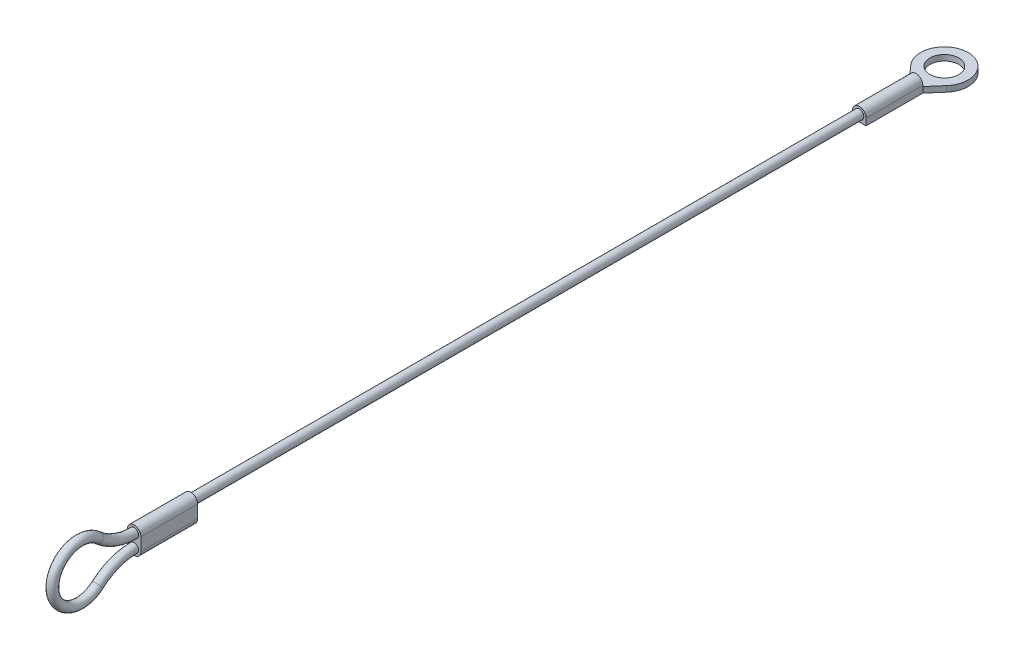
ISO-10303-21;
HEADER;
FILE_DESCRIPTION(('STEP AP214'),'2;1');
FILE_NAME('part.step','',(''),(''),'','','');
FILE_SCHEMA(('AUTOMOTIVE_DESIGN { 1 0 10303 214 1 1 1 1 }'));
ENDSEC;
DATA;
#1=APPLICATION_CONTEXT('core data for automotive mechanical design processes');
#2=APPLICATION_PROTOCOL_DEFINITION('international standard','automotive_design',2000,#1);
#3=PRODUCT_CONTEXT('',#1,'mechanical');
#4=PRODUCT('Part','Part','',(#3));
#5=PRODUCT_RELATED_PRODUCT_CATEGORY('part','',(#4));
#6=PRODUCT_DEFINITION_FORMATION('','',#4);
#7=PRODUCT_DEFINITION_CONTEXT('part definition',#1,'design');
#8=PRODUCT_DEFINITION('design','',#6,#7);
#9=PRODUCT_DEFINITION_SHAPE('','',#8);
#10=(LENGTH_UNIT() NAMED_UNIT(*) SI_UNIT(.MILLI.,.METRE.));
#11=(NAMED_UNIT(*) PLANE_ANGLE_UNIT() SI_UNIT($,.RADIAN.));
#12=(NAMED_UNIT(*) SI_UNIT($,.STERADIAN.) SOLID_ANGLE_UNIT());
#13=UNCERTAINTY_MEASURE_WITH_UNIT(LENGTH_MEASURE(1.E-05),#10,'distance_accuracy_value','');
#14=(GEOMETRIC_REPRESENTATION_CONTEXT(3) GLOBAL_UNCERTAINTY_ASSIGNED_CONTEXT((#13)) GLOBAL_UNIT_ASSIGNED_CONTEXT((#10,
#11,#12)) REPRESENTATION_CONTEXT('',''));
#15=CARTESIAN_POINT('',(0.,0.,0.));
#16=DIRECTION('',(0.,0.,1.));
#17=DIRECTION('',(1.,0.,0.));
#18=AXIS2_PLACEMENT_3D('',#15,#16,#17);
#19=CARTESIAN_POINT('',(0.,0.,-10.));
#20=DIRECTION('',(0.,0.,-1.));
#21=DIRECTION('',(-1.,0.,0.));
#22=AXIS2_PLACEMENT_3D('',#19,#20,#21);
#23=PLANE('',#22);
#24=DIRECTION('',(0.,-1.,0.));
#25=VECTOR('',#24,1.);
#26=CARTESIAN_POINT('',(1.2,0.,-10.));
#27=LINE('',#26,#25);
#28=CARTESIAN_POINT('',(1.2,0.,-10.));
#29=VERTEX_POINT('',#28);
#30=CARTESIAN_POINT('',(1.2,-0.19,-10.));
#31=VERTEX_POINT('',#30);
#32=EDGE_CURVE('E189',#29,#31,#27,.T.);
#33=ORIENTED_EDGE('',*,*,#32,.T.);
#34=DIRECTION('',(-1.,0.,0.));
#35=VECTOR('',#34,1.);
#36=CARTESIAN_POINT('',(-1.2,-0.19,-10.));
#37=LINE('',#36,#35);
#38=CARTESIAN_POINT('',(-1.2,-0.19,-10.));
#39=VERTEX_POINT('',#38);
#40=EDGE_CURVE('E146',#31,#39,#37,.T.);
#41=ORIENTED_EDGE('',*,*,#40,.T.);
#42=DIRECTION('',(0.,1.,0.));
#43=VECTOR('',#42,1.);
#44=CARTESIAN_POINT('',(-1.2,-1.2,-10.));
#45=LINE('',#44,#43);
#46=CARTESIAN_POINT('',(-1.2,0.,-10.));
#47=VERTEX_POINT('',#46);
#48=EDGE_CURVE('E194',#39,#47,#45,.T.);
#49=ORIENTED_EDGE('',*,*,#48,.T.);
#50=CARTESIAN_POINT('',(0.,0.,-10.));
#51=DIRECTION('',(0.,0.,-1.));
#52=DIRECTION('',(-1.,0.,0.));
#53=AXIS2_PLACEMENT_3D('',#50,#51,#52);
#54=CIRCLE('',#53,1.2);
#55=EDGE_CURVE('E185',#47,#29,#54,.T.);
#56=ORIENTED_EDGE('',*,*,#55,.T.);
#57=EDGE_LOOP('',(#33,#41,#49,#56));
#58=FACE_BOUND('',#57,.T.);
#59=ADVANCED_FACE('F39',(#58),#23,.T.);
#60=CARTESIAN_POINT('',(0.,0.,127.8));
#61=DIRECTION('',(0.,0.,-1.));
#62=DIRECTION('',(-1.,0.,0.));
#63=AXIS2_PLACEMENT_3D('',#60,#61,#62);
#64=CYLINDRICAL_SURFACE('',#63,0.795);
#65=CARTESIAN_POINT('',(0.,0.,117.8));
#66=DIRECTION('',(0.,0.,-1.));
#67=DIRECTION('',(0.,1.,0.));
#68=AXIS2_PLACEMENT_3D('',#65,#66,#67);
#69=CIRCLE('',#68,0.795);
#70=CARTESIAN_POINT('',(0.,0.795,117.8));
#71=VERTEX_POINT('',#70);
#72=EDGE_CURVE('E43',#71,#71,#69,.T.);
#73=ORIENTED_EDGE('',*,*,#72,.T.);
#74=EDGE_LOOP('',(#73));
#75=FACE_BOUND('',#74,.T.);
#76=CARTESIAN_POINT('',(0.,0.,0.));
#77=DIRECTION('',(0.,0.,1.));
#78=DIRECTION('',(1.,0.,0.));
#79=AXIS2_PLACEMENT_3D('',#76,#77,#78);
#80=CIRCLE('',#79,0.795);
#81=CARTESIAN_POINT('',(0.795,0.,0.));
#82=VERTEX_POINT('',#81);
#83=EDGE_CURVE('E224',#82,#82,#80,.T.);
#84=ORIENTED_EDGE('',*,*,#83,.T.);
#85=EDGE_LOOP('',(#84));
#86=FACE_BOUND('',#85,.T.);
#87=ADVANCED_FACE('F41',(#75,#86),#64,.T.);
#88=CARTESIAN_POINT('',(0.,1.70292021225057E-13,117.8));
#89=DIRECTION('',(0.,0.,1.));
#90=DIRECTION('',(0.,-1.,0.));
#91=AXIS2_PLACEMENT_3D('',#88,#89,#90);
#92=CYLINDRICAL_SURFACE('',#91,1.2);
#93=CARTESIAN_POINT('',(0.,1.8474805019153E-13,127.8));
#94=DIRECTION('',(0.,0.,-1.));
#95=DIRECTION('',(0.,1.,0.));
#96=AXIS2_PLACEMENT_3D('',#93,#94,#95);
#97=CIRCLE('',#96,1.2);
#98=CARTESIAN_POINT('',(-1.2,1.84895007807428E-13,127.8));
#99=VERTEX_POINT('',#98);
#100=CARTESIAN_POINT('',(1.2,1.84601092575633E-13,127.8));
#101=VERTEX_POINT('',#100);
#102=EDGE_CURVE('E236',#99,#101,#97,.T.);
#103=ORIENTED_EDGE('',*,*,#102,.T.);
#104=DIRECTION('',(0.,0.,1.));
#105=VECTOR('',#104,1.);
#106=CARTESIAN_POINT('',(1.2,1.70145063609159E-13,117.8));
#107=LINE('',#106,#105);
#108=CARTESIAN_POINT('',(1.2,1.70145063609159E-13,117.8));
#109=VERTEX_POINT('',#108);
#110=EDGE_CURVE('E257',#109,#101,#107,.T.);
#111=ORIENTED_EDGE('',*,*,#110,.F.);
#112=CARTESIAN_POINT('',(0.,1.70292021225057E-13,117.8));
#113=DIRECTION('',(0.,0.,-1.));
#114=DIRECTION('',(0.,1.,0.));
#115=AXIS2_PLACEMENT_3D('',#112,#113,#114);
#116=CIRCLE('',#115,1.2);
#117=CARTESIAN_POINT('',(-1.2,1.70438978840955E-13,117.8));
#118=VERTEX_POINT('',#117);
#119=EDGE_CURVE('E225',#118,#109,#116,.T.);
#120=ORIENTED_EDGE('',*,*,#119,.F.);
#121=DIRECTION('',(0.,0.,1.));
#122=VECTOR('',#121,1.);
#123=CARTESIAN_POINT('',(-1.2,1.70438978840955E-13,117.8));
#124=LINE('',#123,#122);
#125=EDGE_CURVE('E235',#118,#99,#124,.T.);
#126=ORIENTED_EDGE('',*,*,#125,.T.);
#127=EDGE_LOOP('',(#103,#111,#120,#126));
#128=FACE_BOUND('',#127,.T.);
#129=ADVANCED_FACE('F313',(#128),#92,.T.);
#130=CARTESIAN_POINT('',(1.2,1.70145063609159E-13,117.8));
#131=DIRECTION('',(-1.,0.,0.));
#132=DIRECTION('',(0.,-1.,0.));
#133=AXIS2_PLACEMENT_3D('',#130,#131,#132);
#134=PLANE('',#133);
#135=DIRECTION('',(0.,-1.,0.));
#136=VECTOR('',#135,1.);
#137=CARTESIAN_POINT('',(1.2,1.84601092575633E-13,127.8));
#138=LINE('',#137,#136);
#139=CARTESIAN_POINT('',(1.2,-2.26625258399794,127.8));
#140=VERTEX_POINT('',#139);
#141=EDGE_CURVE('E240',#101,#140,#138,.T.);
#142=ORIENTED_EDGE('',*,*,#141,.T.);
#143=DIRECTION('',(0.,0.,1.));
#144=VECTOR('',#143,1.);
#145=CARTESIAN_POINT('',(1.2,-2.26625258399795,117.8));
#146=LINE('',#145,#144);
#147=CARTESIAN_POINT('',(1.2,-2.26625258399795,117.8));
#148=VERTEX_POINT('',#147);
#149=EDGE_CURVE('E253',#148,#140,#146,.T.);
#150=ORIENTED_EDGE('',*,*,#149,.F.);
#151=DIRECTION('',(0.,-1.,0.));
#152=VECTOR('',#151,1.);
#153=CARTESIAN_POINT('',(1.2,1.70145063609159E-13,117.8));
#154=LINE('',#153,#152);
#155=EDGE_CURVE('E95',#109,#148,#154,.T.);
#156=ORIENTED_EDGE('',*,*,#155,.F.);
#157=ORIENTED_EDGE('',*,*,#110,.T.);
#158=EDGE_LOOP('',(#142,#150,#156,#157));
#159=FACE_BOUND('',#158,.T.);
#160=ADVANCED_FACE('F315',(#159),#134,.F.);
#161=CARTESIAN_POINT('',(0.,-2.26625258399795,117.8));
#162=DIRECTION('',(0.,0.,1.));
#163=DIRECTION('',(0.,-1.,0.));
#164=AXIS2_PLACEMENT_3D('',#161,#162,#163);
#165=CYLINDRICAL_SURFACE('',#164,1.2);
#166=CARTESIAN_POINT('',(0.,-2.26625258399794,127.8));
#167=DIRECTION('',(0.,0.,-1.));
#168=DIRECTION('',(0.,1.,0.));
#169=AXIS2_PLACEMENT_3D('',#166,#167,#168);
#170=CIRCLE('',#169,1.2);
#171=CARTESIAN_POINT('',(-1.2,-2.26625258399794,127.8));
#172=VERTEX_POINT('',#171);
#173=EDGE_CURVE('E243',#140,#172,#170,.T.);
#174=ORIENTED_EDGE('',*,*,#173,.T.);
#175=DIRECTION('',(0.,0.,1.));
#176=VECTOR('',#175,1.);
#177=CARTESIAN_POINT('',(-1.2,-2.26625258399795,117.8));
#178=LINE('',#177,#176);
#179=CARTESIAN_POINT('',(-1.2,-2.26625258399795,117.8));
#180=VERTEX_POINT('',#179);
#181=EDGE_CURVE('E250',#180,#172,#178,.T.);
#182=ORIENTED_EDGE('',*,*,#181,.F.);
#183=CARTESIAN_POINT('',(0.,-2.26625258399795,117.8));
#184=DIRECTION('',(0.,0.,-1.));
#185=DIRECTION('',(0.,1.,0.));
#186=AXIS2_PLACEMENT_3D('',#183,#184,#185);
#187=CIRCLE('',#186,1.2);
#188=EDGE_CURVE('E230',#148,#180,#187,.T.);
#189=ORIENTED_EDGE('',*,*,#188,.F.);
#190=ORIENTED_EDGE('',*,*,#149,.T.);
#191=EDGE_LOOP('',(#174,#182,#189,#190));
#192=FACE_BOUND('',#191,.T.);
#193=ADVANCED_FACE('F320',(#192),#165,.T.);
#194=CARTESIAN_POINT('',(-1.2,1.70438978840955E-13,117.8));
#195=DIRECTION('',(1.,0.,0.));
#196=DIRECTION('',(0.,0.,-1.));
#197=AXIS2_PLACEMENT_3D('',#194,#195,#196);
#198=PLANE('',#197);
#199=DIRECTION('',(0.,1.,0.));
#200=VECTOR('',#199,1.);
#201=CARTESIAN_POINT('',(-1.2,1.84895007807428E-13,127.8));
#202=LINE('',#201,#200);
#203=EDGE_CURVE('E87',#172,#99,#202,.T.);
#204=ORIENTED_EDGE('',*,*,#203,.T.);
#205=ORIENTED_EDGE('',*,*,#125,.F.);
#206=DIRECTION('',(0.,1.,0.));
#207=VECTOR('',#206,1.);
#208=CARTESIAN_POINT('',(-1.2,1.70438978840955E-13,117.8));
#209=LINE('',#208,#207);
#210=EDGE_CURVE('E66',#180,#118,#209,.T.);
#211=ORIENTED_EDGE('',*,*,#210,.F.);
#212=ORIENTED_EDGE('',*,*,#181,.T.);
#213=EDGE_LOOP('',(#204,#205,#211,#212));
#214=FACE_BOUND('',#213,.T.);
#215=ADVANCED_FACE('F308',(#214),#198,.F.);
#216=CARTESIAN_POINT('',(0.,1.70292021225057E-13,117.8));
#217=DIRECTION('',(0.,0.,-1.));
#218=DIRECTION('',(0.,1.,0.));
#219=AXIS2_PLACEMENT_3D('',#216,#217,#218);
#220=PLANE('',#219);
#221=ORIENTED_EDGE('',*,*,#72,.F.);
#222=EDGE_LOOP('',(#221));
#223=FACE_BOUND('',#222,.T.);
#224=ORIENTED_EDGE('',*,*,#119,.T.);
#225=ORIENTED_EDGE('',*,*,#155,.T.);
#226=ORIENTED_EDGE('',*,*,#188,.T.);
#227=ORIENTED_EDGE('',*,*,#210,.T.);
#228=EDGE_LOOP('',(#224,#225,#226,#227));
#229=FACE_BOUND('',#228,.T.);
#230=ADVANCED_FACE('F305',(#223,#229),#220,.T.);
#231=CARTESIAN_POINT('',(0.,1.8474805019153E-13,127.8));
#232=DIRECTION('',(0.,0.,-1.));
#233=DIRECTION('',(0.,1.,0.));
#234=AXIS2_PLACEMENT_3D('',#231,#232,#233);
#235=PLANE('',#234);
#236=CARTESIAN_POINT('',(0.,-2.26625258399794,127.8));
#237=DIRECTION('',(0.,0.,-1.));
#238=DIRECTION('',(1.,0.,0.));
#239=AXIS2_PLACEMENT_3D('',#236,#237,#238);
#240=CIRCLE('',#239,0.795);
#241=CARTESIAN_POINT('',(0.,-1.47125258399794,127.8));
#242=VERTEX_POINT('',#241);
#243=EDGE_CURVE('E263',#242,#242,#240,.T.);
#244=ORIENTED_EDGE('',*,*,#243,.T.);
#245=EDGE_LOOP('',(#244));
#246=FACE_BOUND('',#245,.T.);
#247=CARTESIAN_POINT('',(0.,0.,127.8));
#248=DIRECTION('',(0.,0.,-1.));
#249=DIRECTION('',(0.,1.,0.));
#250=AXIS2_PLACEMENT_3D('',#247,#248,#249);
#251=CIRCLE('',#250,0.795);
#252=CARTESIAN_POINT('',(0.,-0.795000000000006,127.8));
#253=VERTEX_POINT('',#252);
#254=EDGE_CURVE('E260',#253,#253,#251,.T.);
#255=ORIENTED_EDGE('',*,*,#254,.T.);
#256=EDGE_LOOP('',(#255));
#257=FACE_BOUND('',#256,.T.);
#258=ORIENTED_EDGE('',*,*,#102,.F.);
#259=ORIENTED_EDGE('',*,*,#203,.F.);
#260=ORIENTED_EDGE('',*,*,#173,.F.);
#261=ORIENTED_EDGE('',*,*,#141,.F.);
#262=EDGE_LOOP('',(#258,#259,#260,#261));
#263=FACE_BOUND('',#262,.T.);
#264=ADVANCED_FACE('F307',(#246,#257,#263),#235,.F.);
#265=CARTESIAN_POINT('',(0.,-11.8662525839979,127.8));
#266=DIRECTION('',(1.,0.,0.));
#267=DIRECTION('',(0.,0.,-1.));
#268=AXIS2_PLACEMENT_3D('',#265,#266,#267);
#269=TOROIDAL_SURFACE('',#268,9.6,0.795);
#270=CARTESIAN_POINT('',(0.,-4.71083505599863,134.2));
#271=DIRECTION('',(0.,0.666666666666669,-0.745355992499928));
#272=DIRECTION('',(1.,0.,0.));
#273=AXIS2_PLACEMENT_3D('',#270,#271,#272);
#274=CIRCLE('',#273,0.795);
#275=CARTESIAN_POINT('',(0.,-4.11827704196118,134.73));
#276=VERTEX_POINT('',#275);
#277=EDGE_CURVE('E49',#276,#276,#274,.T.);
#278=CARTESIAN_POINT('',(0.,-11.8662525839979,127.8));
#279=DIRECTION('',(1.,0.,0.));
#280=DIRECTION('',(0.,0.,-1.));
#281=AXIS2_PLACEMENT_3D('',#278,#279,#280);
#282=CIRCLE('',#281,10.395);
#283=EDGE_CURVE('',#242,#276,#282,.T.);
#284=ORIENTED_EDGE('',*,*,#243,.F.);
#285=ORIENTED_EDGE('',*,*,#277,.T.);
#286=ORIENTED_EDGE('',*,*,#283,.T.);
#287=ORIENTED_EDGE('',*,*,#283,.F.);
#288=EDGE_LOOP('',(#284,#286,#285,#287));
#289=FACE_BOUND('',#288,.T.);
#290=ADVANCED_FACE('F323',(#289),#269,.T.);
#291=CARTESIAN_POINT('',(0.,-1.13312629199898,137.4));
#292=DIRECTION('',(-1.,0.,0.));
#293=DIRECTION('',(0.,0.,1.));
#294=AXIS2_PLACEMENT_3D('',#291,#292,#293);
#295=TOROIDAL_SURFACE('',#294,4.79999999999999,0.795);
#296=CARTESIAN_POINT('',(0.,2.44458247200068,134.2));
#297=DIRECTION('',(0.,0.666666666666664,0.745355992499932));
#298=DIRECTION('',(1.,0.,0.));
#299=AXIS2_PLACEMENT_3D('',#296,#297,#298);
#300=CIRCLE('',#299,0.795);
#301=CARTESIAN_POINT('',(0.,1.85202445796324,134.73));
#302=VERTEX_POINT('',#301);
#303=EDGE_CURVE('E11',#302,#302,#300,.T.);
#304=ORIENTED_EDGE('',*,*,#303,.T.);
#305=EDGE_LOOP('',(#304));
#306=FACE_BOUND('',#305,.T.);
#307=ORIENTED_EDGE('',*,*,#277,.F.);
#308=EDGE_LOOP('',(#307));
#309=FACE_BOUND('',#308,.T.);
#310=ADVANCED_FACE('F329',(#306,#309),#295,.T.);
#311=CARTESIAN_POINT('',(0.,9.6,127.8));
#312=DIRECTION('',(1.,0.,0.));
#313=DIRECTION('',(0.,0.,-1.));
#314=AXIS2_PLACEMENT_3D('',#311,#312,#313);
#315=TOROIDAL_SURFACE('',#314,9.6,0.795);
#316=CARTESIAN_POINT('',(0.,9.6,127.8));
#317=DIRECTION('',(1.,0.,0.));
#318=DIRECTION('',(0.,0.,-1.));
#319=AXIS2_PLACEMENT_3D('',#316,#317,#318);
#320=CIRCLE('',#319,10.395);
#321=EDGE_CURVE('',#302,#253,#320,.T.);
#322=ORIENTED_EDGE('',*,*,#303,.F.);
#323=ORIENTED_EDGE('',*,*,#254,.F.);
#324=ORIENTED_EDGE('',*,*,#321,.T.);
#325=ORIENTED_EDGE('',*,*,#321,.F.);
#326=EDGE_LOOP('',(#322,#324,#323,#325));
#327=FACE_BOUND('',#326,.T.);
#328=ADVANCED_FACE('F349',(#327),#315,.T.);
#329=CARTESIAN_POINT('',(0.,0.,-10.));
#330=DIRECTION('',(0.,0.,1.));
#331=DIRECTION('',(1.,0.,0.));
#332=AXIS2_PLACEMENT_3D('',#329,#330,#331);
#333=CYLINDRICAL_SURFACE('',#332,1.2);
#334=CARTESIAN_POINT('',(0.,0.,0.));
#335=DIRECTION('',(0.,0.,-1.));
#336=DIRECTION('',(-1.,0.,0.));
#337=AXIS2_PLACEMENT_3D('',#334,#335,#336);
#338=CIRCLE('',#337,1.2);
#339=CARTESIAN_POINT('',(-1.2,0.,0.));
#340=VERTEX_POINT('',#339);
#341=CARTESIAN_POINT('',(1.2,0.,0.));
#342=VERTEX_POINT('',#341);
#343=EDGE_CURVE('E182',#340,#342,#338,.T.);
#344=ORIENTED_EDGE('',*,*,#343,.T.);
#345=DIRECTION('',(0.,0.,1.));
#346=VECTOR('',#345,1.);
#347=CARTESIAN_POINT('',(1.2,0.,-10.));
#348=LINE('',#347,#346);
#349=EDGE_CURVE('E220',#29,#342,#348,.T.);
#350=ORIENTED_EDGE('',*,*,#349,.F.);
#351=ORIENTED_EDGE('',*,*,#55,.F.);
#352=DIRECTION('',(0.,0.,1.));
#353=VECTOR('',#352,1.);
#354=CARTESIAN_POINT('',(-1.2,0.,-10.));
#355=LINE('',#354,#353);
#356=EDGE_CURVE('E197',#47,#340,#355,.T.);
#357=ORIENTED_EDGE('',*,*,#356,.T.);
#358=EDGE_LOOP('',(#344,#350,#351,#357));
#359=FACE_BOUND('',#358,.T.);
#360=ADVANCED_FACE('F283',(#359),#333,.T.);
#361=CARTESIAN_POINT('',(1.2,0.,-10.));
#362=DIRECTION('',(-1.,0.,0.));
#363=DIRECTION('',(0.,0.,1.));
#364=AXIS2_PLACEMENT_3D('',#361,#362,#363);
#365=PLANE('',#364);
#366=DIRECTION('',(0.,-1.,0.));
#367=VECTOR('',#366,1.);
#368=CARTESIAN_POINT('',(1.2,0.,0.));
#369=LINE('',#368,#367);
#370=CARTESIAN_POINT('',(1.2,-1.2,0.));
#371=VERTEX_POINT('',#370);
#372=EDGE_CURVE('E201',#342,#371,#369,.T.);
#373=ORIENTED_EDGE('',*,*,#372,.T.);
#374=DIRECTION('',(0.,0.,1.));
#375=VECTOR('',#374,1.);
#376=CARTESIAN_POINT('',(1.2,-1.2,-10.));
#377=LINE('',#376,#375);
#378=CARTESIAN_POINT('',(1.2,-1.2,-10.));
#379=VERTEX_POINT('',#378);
#380=EDGE_CURVE('E216',#379,#371,#377,.T.);
#381=ORIENTED_EDGE('',*,*,#380,.F.);
#382=DIRECTION('',(0.,-1.,0.));
#383=VECTOR('',#382,1.);
#384=CARTESIAN_POINT('',(1.2,-0.19,-10.));
#385=LINE('',#384,#383);
#386=EDGE_CURVE('E179',#31,#379,#385,.T.);
#387=ORIENTED_EDGE('',*,*,#386,.F.);
#388=ORIENTED_EDGE('',*,*,#32,.F.);
#389=ORIENTED_EDGE('',*,*,#349,.T.);
#390=EDGE_LOOP('',(#373,#381,#387,#388,#389));
#391=FACE_BOUND('',#390,.T.);
#392=ADVANCED_FACE('F294',(#391),#365,.F.);
#393=CARTESIAN_POINT('',(0.,-1.2,-10.));
#394=DIRECTION('',(0.,1.,0.));
#395=DIRECTION('',(0.,0.,1.));
#396=AXIS2_PLACEMENT_3D('',#393,#394,#395);
#397=PLANE('',#396);
#398=DIRECTION('',(-1.,0.,0.));
#399=VECTOR('',#398,1.);
#400=CARTESIAN_POINT('',(0.,-1.2,0.));
#401=LINE('',#400,#399);
#402=CARTESIAN_POINT('',(-1.2,-1.2,0.));
#403=VERTEX_POINT('',#402);
#404=EDGE_CURVE('E204',#371,#403,#401,.T.);
#405=ORIENTED_EDGE('',*,*,#404,.T.);
#406=DIRECTION('',(0.,0.,1.));
#407=VECTOR('',#406,1.);
#408=CARTESIAN_POINT('',(-1.2,-1.2,-10.));
#409=LINE('',#408,#407);
#410=CARTESIAN_POINT('',(-1.2,-1.2,-10.));
#411=VERTEX_POINT('',#410);
#412=EDGE_CURVE('E212',#411,#403,#409,.T.);
#413=ORIENTED_EDGE('',*,*,#412,.F.);
#414=DIRECTION('',(-0.657083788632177,0.,-0.753817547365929));
#415=VECTOR('',#414,1.);
#416=CARTESIAN_POINT('',(-3.15849552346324,-1.2,-12.2468189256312));
#417=LINE('',#416,#415);
#418=CARTESIAN_POINT('',(-3.15849552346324,-1.2,-12.2468189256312));
#419=VERTEX_POINT('',#418);
#420=EDGE_CURVE('E173',#411,#419,#417,.T.);
#421=ORIENTED_EDGE('',*,*,#420,.T.);
#422=CARTESIAN_POINT('',(0.,-1.2,-15.));
#423=DIRECTION('',(0.,-1.,0.));
#424=DIRECTION('',(0.,0.,1.));
#425=AXIS2_PLACEMENT_3D('',#422,#423,#424);
#426=CIRCLE('',#425,4.19);
#427=CARTESIAN_POINT('',(3.15849552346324,-1.2,-12.2468189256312));
#428=VERTEX_POINT('',#427);
#429=EDGE_CURVE('E141',#419,#428,#426,.T.);
#430=ORIENTED_EDGE('',*,*,#429,.T.);
#431=DIRECTION('',(-0.657083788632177,0.,0.753817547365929));
#432=VECTOR('',#431,1.);
#433=CARTESIAN_POINT('',(1.2,-1.2,-10.));
#434=LINE('',#433,#432);
#435=EDGE_CURVE('E158',#428,#379,#434,.T.);
#436=ORIENTED_EDGE('',*,*,#435,.T.);
#437=ORIENTED_EDGE('',*,*,#380,.T.);
#438=EDGE_LOOP('',(#405,#413,#421,#430,#436,#437));
#439=FACE_BOUND('',#438,.T.);
#440=CARTESIAN_POINT('',(0.,-1.2,-15.));
#441=DIRECTION('',(0.,-1.,0.));
#442=DIRECTION('',(0.,0.,-1.));
#443=AXIS2_PLACEMENT_3D('',#440,#441,#442);
#444=CIRCLE('',#443,2.54);
#445=CARTESIAN_POINT('',(0.,-1.2,-17.54));
#446=VERTEX_POINT('',#445);
#447=EDGE_CURVE('E166',#446,#446,#444,.T.);
#448=ORIENTED_EDGE('',*,*,#447,.F.);
#449=EDGE_LOOP('',(#448));
#450=FACE_BOUND('',#449,.T.);
#451=ADVANCED_FACE('F290',(#439,#450),#397,.F.);
#452=CARTESIAN_POINT('',(-1.2,-1.2,-10.));
#453=DIRECTION('',(1.,0.,0.));
#454=DIRECTION('',(0.,0.,-1.));
#455=AXIS2_PLACEMENT_3D('',#452,#453,#454);
#456=PLANE('',#455);
#457=DIRECTION('',(0.,1.,0.));
#458=VECTOR('',#457,1.);
#459=CARTESIAN_POINT('',(-1.2,-1.2,0.));
#460=LINE('',#459,#458);
#461=EDGE_CURVE('E190',#403,#340,#460,.T.);
#462=ORIENTED_EDGE('',*,*,#461,.T.);
#463=ORIENTED_EDGE('',*,*,#356,.F.);
#464=ORIENTED_EDGE('',*,*,#48,.F.);
#465=EDGE_CURVE('E155',#411,#39,#45,.T.);
#466=ORIENTED_EDGE('',*,*,#465,.F.);
#467=ORIENTED_EDGE('',*,*,#412,.T.);
#468=EDGE_LOOP('',(#462,#463,#464,#466,#467));
#469=FACE_BOUND('',#468,.T.);
#470=ADVANCED_FACE('F277',(#469),#456,.F.);
#471=CARTESIAN_POINT('',(0.,0.,0.));
#472=DIRECTION('',(0.,0.,-1.));
#473=DIRECTION('',(-1.,0.,0.));
#474=AXIS2_PLACEMENT_3D('',#471,#472,#473);
#475=PLANE('',#474);
#476=ORIENTED_EDGE('',*,*,#83,.F.);
#477=EDGE_LOOP('',(#476));
#478=FACE_BOUND('',#477,.T.);
#479=ORIENTED_EDGE('',*,*,#343,.F.);
#480=ORIENTED_EDGE('',*,*,#461,.F.);
#481=ORIENTED_EDGE('',*,*,#404,.F.);
#482=ORIENTED_EDGE('',*,*,#372,.F.);
#483=EDGE_LOOP('',(#479,#480,#481,#482));
#484=FACE_BOUND('',#483,.T.);
#485=ADVANCED_FACE('F274',(#478,#484),#475,.F.);
#486=CARTESIAN_POINT('',(-3.15849552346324,-0.19,-12.2468189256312));
#487=DIRECTION('',(-0.753817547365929,0.,0.657083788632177));
#488=DIRECTION('',(0.657083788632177,0.,0.753817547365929));
#489=AXIS2_PLACEMENT_3D('',#486,#487,#488);
#490=PLANE('',#489);
#491=ORIENTED_EDGE('',*,*,#420,.F.);
#492=ORIENTED_EDGE('',*,*,#465,.T.);
#493=DIRECTION('',(-0.657083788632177,0.,-0.753817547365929));
#494=VECTOR('',#493,1.);
#495=CARTESIAN_POINT('',(-3.15849552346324,-0.19,-12.2468189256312));
#496=LINE('',#495,#494);
#497=CARTESIAN_POINT('',(-3.15849552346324,-0.19,-12.2468189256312));
#498=VERTEX_POINT('',#497);
#499=EDGE_CURVE('E57',#39,#498,#496,.T.);
#500=ORIENTED_EDGE('',*,*,#499,.T.);
#501=DIRECTION('',(0.,-1.,0.));
#502=VECTOR('',#501,1.);
#503=CARTESIAN_POINT('',(-3.15849552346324,-0.19,-12.2468189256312));
#504=LINE('',#503,#502);
#505=EDGE_CURVE('E137',#498,#419,#504,.T.);
#506=ORIENTED_EDGE('',*,*,#505,.T.);
#507=EDGE_LOOP('',(#491,#492,#500,#506));
#508=FACE_BOUND('',#507,.T.);
#509=ADVANCED_FACE('F153',(#508),#490,.T.);
#510=CARTESIAN_POINT('',(1.2,-0.19,-10.));
#511=DIRECTION('',(0.753817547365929,0.,0.657083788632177));
#512=DIRECTION('',(0.657083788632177,0.,-0.753817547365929));
#513=AXIS2_PLACEMENT_3D('',#510,#511,#512);
#514=PLANE('',#513);
#515=ORIENTED_EDGE('',*,*,#435,.F.);
#516=DIRECTION('',(0.,-1.,0.));
#517=VECTOR('',#516,1.);
#518=CARTESIAN_POINT('',(3.15849552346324,-0.19,-12.2468189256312));
#519=LINE('',#518,#517);
#520=CARTESIAN_POINT('',(3.15849552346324,-0.19,-12.2468189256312));
#521=VERTEX_POINT('',#520);
#522=EDGE_CURVE('E145',#521,#428,#519,.T.);
#523=ORIENTED_EDGE('',*,*,#522,.F.);
#524=DIRECTION('',(-0.657083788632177,0.,0.753817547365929));
#525=VECTOR('',#524,1.);
#526=CARTESIAN_POINT('',(1.2,-0.19,-10.));
#527=LINE('',#526,#525);
#528=EDGE_CURVE('E150',#521,#31,#527,.T.);
#529=ORIENTED_EDGE('',*,*,#528,.T.);
#530=ORIENTED_EDGE('',*,*,#386,.T.);
#531=EDGE_LOOP('',(#515,#523,#529,#530));
#532=FACE_BOUND('',#531,.T.);
#533=ADVANCED_FACE('F423',(#532),#514,.T.);
#534=CARTESIAN_POINT('',(0.,-0.19,-15.));
#535=DIRECTION('',(0.,-1.,0.));
#536=DIRECTION('',(0.,0.,-1.));
#537=AXIS2_PLACEMENT_3D('',#534,#535,#536);
#538=CYLINDRICAL_SURFACE('',#537,4.19);
#539=ORIENTED_EDGE('',*,*,#429,.F.);
#540=ORIENTED_EDGE('',*,*,#505,.F.);
#541=CARTESIAN_POINT('',(0.,-0.19,-15.));
#542=DIRECTION('',(0.,-1.,0.));
#543=DIRECTION('',(0.,0.,1.));
#544=AXIS2_PLACEMENT_3D('',#541,#542,#543);
#545=CIRCLE('',#544,4.19);
#546=EDGE_CURVE('E139',#498,#521,#545,.T.);
#547=ORIENTED_EDGE('',*,*,#546,.T.);
#548=ORIENTED_EDGE('',*,*,#522,.T.);
#549=EDGE_LOOP('',(#539,#540,#547,#548));
#550=FACE_BOUND('',#549,.T.);
#551=ADVANCED_FACE('F138',(#550),#538,.T.);
#552=CARTESIAN_POINT('',(0.,-0.19,-15.));
#553=DIRECTION('',(0.,1.,0.));
#554=DIRECTION('',(0.,0.,1.));
#555=AXIS2_PLACEMENT_3D('',#552,#553,#554);
#556=PLANE('',#555);
#557=CARTESIAN_POINT('',(0.,-0.19,-15.));
#558=DIRECTION('',(0.,-1.,0.));
#559=DIRECTION('',(0.,0.,-1.));
#560=AXIS2_PLACEMENT_3D('',#557,#558,#559);
#561=CIRCLE('',#560,2.54);
#562=CARTESIAN_POINT('',(0.,-0.19,-17.54));
#563=VERTEX_POINT('',#562);
#564=EDGE_CURVE('E176',#563,#563,#561,.T.);
#565=ORIENTED_EDGE('',*,*,#564,.T.);
#566=EDGE_LOOP('',(#565));
#567=FACE_BOUND('',#566,.T.);
#568=ORIENTED_EDGE('',*,*,#499,.F.);
#569=ORIENTED_EDGE('',*,*,#40,.F.);
#570=ORIENTED_EDGE('',*,*,#528,.F.);
#571=ORIENTED_EDGE('',*,*,#546,.F.);
#572=EDGE_LOOP('',(#568,#569,#570,#571));
#573=FACE_BOUND('',#572,.T.);
#574=ADVANCED_FACE('F149',(#567,#573),#556,.T.);
#575=CARTESIAN_POINT('',(0.,-0.19,-15.));
#576=DIRECTION('',(0.,-1.,0.));
#577=DIRECTION('',(0.,0.,-1.));
#578=AXIS2_PLACEMENT_3D('',#575,#576,#577);
#579=CYLINDRICAL_SURFACE('',#578,2.54);
#580=ORIENTED_EDGE('',*,*,#564,.F.);
#581=EDGE_LOOP('',(#580));
#582=FACE_BOUND('',#581,.T.);
#583=ORIENTED_EDGE('',*,*,#447,.T.);
#584=EDGE_LOOP('',(#583));
#585=FACE_BOUND('',#584,.T.);
#586=ADVANCED_FACE('F444',(#582,#585),#579,.F.);
#587=CLOSED_SHELL('',(#59,#87,#129,#160,#193,#215,#230,#264,#290,#310,#328,#360,#392,#451,#470,
#485,#509,#533,#551,#574,#586));
#588=MANIFOLD_SOLID_BREP('B2',#587);
#589=ADVANCED_BREP_SHAPE_REPRESENTATION('',(#18,#588),#14);
#590=SHAPE_DEFINITION_REPRESENTATION(#9,#589);
ENDSEC;
END-ISO-10303-21;
